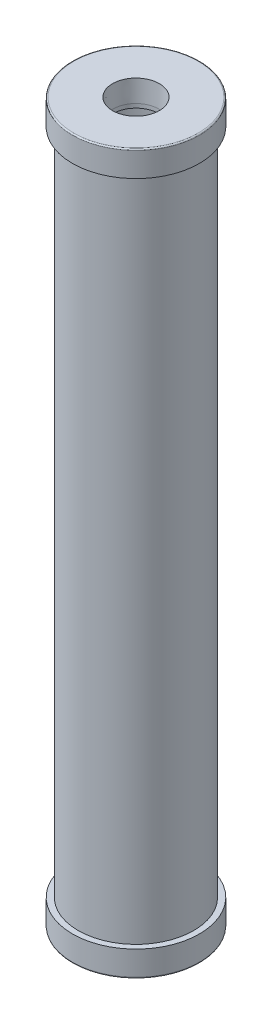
from build123d import *

# Parameters (mm, degrees)
SKETCH1_R           = 57.15
SKETCH1_R_2         = 50.546
BOSS_EXTRUDE1_DEPTH = 711.2
SKETCH2_R           = 62.865
BOSS_EXTRUDE2_DEPTH = 25.4
BOSS_EXTRUDE3_START = -25.4
SKETCH5_R           = 62.865
BOSS_EXTRUDE3_DEPTH = 25.4
FILLET1_R           = 1.27


with BuildPart() as part:
    # Sketch1 → Boss-Extrude1 (new body)
    with BuildSketch(Plane(origin=(0, 0, 0), x_dir=(1, 0, 0), z_dir=(0, 1, 0))):
        with Locations(Location((0, 0, 0), (0, 0, 270))):
            Circle(SKETCH1_R)
        with Locations(Location((0, 0, 0), (0, 0, 270))):
            Circle(SKETCH1_R_2, mode=Mode.SUBTRACT)
    extrude(amount=BOSS_EXTRUDE1_DEPTH)

    # Sketch2 → Boss-Extrude2 (add)
    with BuildSketch(Plane(origin=(0, 0, 0), x_dir=(1, 0, 0), z_dir=(0, 1, 0))):
        with Locations(Location((0, 0, 0), (0, 0, 270))):
            Circle(SKETCH2_R)
    extrude(amount=BOSS_EXTRUDE2_DEPTH)

    # Sketch3 → 1-1_2 Rc Tapped Hole1 (revolve, cut)
    with BuildSketch(Plane(origin=(0, 0, 0), x_dir=(0, 0, -1), z_dir=(1, 0, 0))):
        Polygon((0, 0), (0, 46.34544999), (22.6, 32.766), (22.6, 21.336), (22.493964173, 21.336), (23.160002, 0), align=None)
    revolve(axis=Axis((0, -6.35, 0), (0, 1, 0)), mode=Mode.SUBTRACT)

    # Sketch5 → Boss-Extrude3 (add)
    with BuildSketch(Plane(origin=(0, 711.2, 0), x_dir=(1, 0, 0), z_dir=(0, 1, 0)).offset(BOSS_EXTRUDE3_START)):
        with Locations(Location((0, 0, 0), (0, 0, 270))):
            Circle(SKETCH5_R)
    extrude(amount=BOSS_EXTRUDE3_DEPTH)

    # Sketch6 → 1-1_2 Rc Tapped Hole2 (revolve, cut)
    with BuildSketch(Plane(origin=(0, 711.2, 0), x_dir=(0, 0, 1), z_dir=(1, 0, 0))):
        Polygon((0, 0), (0, 46.34544999), (22.6, 32.766), (22.6, 21.336), (22.493964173, 21.336), (23.160002, 0), align=None)
    revolve(axis=Axis((0, 717.55, 0), (0, -1, 0)), mode=Mode.SUBTRACT)

    # Fillet1
    fillet1_edges = [part.edges().sort_by_distance(p)[0] for p in [
        (0, 0, -62.865),
        (0, 711.2, -62.865),
    ]]
    fillet(fillet1_edges, radius=FILLET1_R)


solid = part.part
